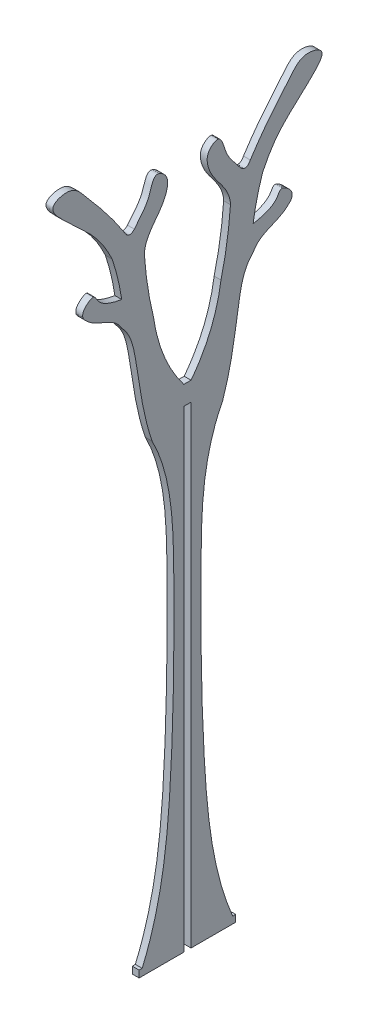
from build123d import *

# Parameters (mm, degrees)
ESTRUSIONE_ESTRUSIONE3_DEPTH = 18


with BuildPart() as part:
    # Schizzo7 → Estrusione-Estrusione3 (new body)
    with BuildSketch(Plane(origin=(0, 0, 0), x_dir=(0, 0, -1), z_dir=(1, 0, 0))):
        with BuildLine():
            Line((-476.786070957, 1122.780178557), (-457.786070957, 1122.780178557))
            Line((-457.786070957, 1122.780178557), (-457.78607096, -120.065063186))
            Line((-457.78607096, -120.065063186), (-340.32855238, -120.065063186))
            Line((-340.32855238, -120.065063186), (-340.32855238, -102.065063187))
            Line((-340.32855238, -102.065063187), (-348.327513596, -102.065063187))
            add(Edge.make_bspline(
                [(-374.416732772, 1085.290340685), (-428.763865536, 980.408727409), (-433.488963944, 703.166417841), (-430.841066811, 362.214519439), (-406.758439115, 77.353361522), (-370.406574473, -50.347198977), (-348.327513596, -102.065063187)],
                knots=[0, 0, 0, 0, 0.287218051, 0.658216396, 0.847460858, 0.984083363, 0.984083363, 0.984083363, 0.984083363], degree=3))
            add(Edge.make_bspline(
                [(-374.416732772, 1085.290340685), (-361.752567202, 1122.390121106), (-345.048249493, 1194.307016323), (-332.104046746, 1296.672666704), (-317.21544491, 1359.36695552), (-294.569377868, 1382.195788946)],
                knots=[0, 0, 0, 0, 0.379260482, 0.713287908, 1, 1, 1, 1], degree=3))
            add(Edge.make_bspline(
                [(-201.939813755, 1445.091225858), (-228.746989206, 1417.179167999), (-275.310990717, 1418.995866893), (-294.569377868, 1382.195788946)],
                knots=[0, 0, 0, 0, 1, 1, 1, 1], degree=3))
            add(Edge.make_bspline(
                [(-201.939813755, 1445.091225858), (-182.916466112, 1459.20417598), (-195.762265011, 1480.591589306), (-223.101636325, 1493.519887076), (-230.565968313, 1475.071968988), (-252.114591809, 1456.460614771), (-277.468960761, 1450.457656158), (-294.569377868, 1447.525569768)],
                knots=[0, 0, 0, 0, 0.336795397, 0.409108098, 0.521188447, 0.643455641, 1, 1, 1, 1], degree=3))
            add(Edge.make_bspline(
                [(-294.569377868, 1447.525569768), (-286.733849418, 1500.793213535), (-269.555985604, 1551.905314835)],
                knots=[0, 0, 0, 1, 1, 1], degree=2))
            add(Edge.make_bspline(
                [(-269.555985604, 1551.905314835), (-232.350307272, 1630.144271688), (-191.88912575, 1651.420554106), (-94.306678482, 1752.338805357), (-154.290662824, 1769.358834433), (-181.756758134, 1751.890311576), (-205.907260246, 1720.877949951), (-249.189179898, 1672.395372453), (-282.701001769, 1625.949832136), (-301.940349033, 1596.300738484)],
                knots=[0, 0, 0, 0, 0.385763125, 0.485334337, 0.571206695, 0.624037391, 0.671733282, 0.795732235, 1, 1, 1, 1], degree=3))
            add(Edge.make_bspline(
                [(-301.940349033, 1596.300738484), (-312.750016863, 1576.237949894), (-327.745318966, 1591.227625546)],
                knots=[0, 0, 0, 1, 1, 1], degree=2))
            add(Edge.make_bspline(
                [(-354.085962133, 1520.557595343), (-354.520611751, 1538.736346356), (-369.940174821, 1570.584189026), (-398.088276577, 1601.986118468), (-410.702447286, 1628.394502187), (-416.129467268, 1648.963321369), (-415.375831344, 1672.971522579), (-380.11555723, 1696.407856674), (-365.079033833, 1632.740590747), (-349.42435991, 1619.179279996), (-327.745318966, 1591.227625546)],
                knots=[0, 0, 0, 0, 0.174589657, 0.335888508, 0.411381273, 0.458067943, 0.543973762, 0.636309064, 0.747697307, 1, 1, 1, 1], degree=3))
            add(Edge.make_bspline(
                [(-354.085962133, 1520.557595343), (-359.632506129, 1440.050330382), (-379.003516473, 1361.525252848)],
                knots=[0, 0, 0, 1, 1, 1], degree=2))
            add(Edge.make_bspline(
                [(-457.78607096, 1172.780178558), (-394.540775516, 1255.12690743), (-379.003516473, 1361.525252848)],
                knots=[0, 0, 0, 1, 1, 1], degree=2))
            Line((-457.78607096, 1172.780178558), (-476.78607096, 1172.780178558))
            add(Edge.make_bspline(
                [(-476.78607096, 1172.780178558), (-540.031366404, 1255.12690743), (-555.568625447, 1361.525252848)],
                knots=[0, 0, 0, 1, 1, 1], degree=2))
            add(Edge.make_bspline(
                [(-580.486179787, 1520.557595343), (-574.939635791, 1440.050330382), (-555.568625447, 1361.525252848)],
                knots=[0, 0, 0, 1, 1, 1], degree=2))
            add(Edge.make_bspline(
                [(-580.486179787, 1520.557595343), (-580.051530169, 1538.736346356), (-564.631967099, 1570.584189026), (-536.483865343, 1601.986118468), (-523.869694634, 1628.394502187), (-518.442674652, 1648.963321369), (-519.196310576, 1672.971522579), (-554.45658469, 1696.407856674), (-569.493108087, 1632.740590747), (-585.14778201, 1619.179279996), (-606.826822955, 1591.227625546)],
                knots=[0, 0, 0, 0, 0.174589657, 0.335888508, 0.411381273, 0.458067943, 0.543973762, 0.636309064, 0.747697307, 1, 1, 1, 1], degree=3))
            add(Edge.make_bspline(
                [(-632.631792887, 1596.300738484), (-621.822125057, 1576.237949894), (-606.826822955, 1591.227625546)],
                knots=[0, 0, 0, 1, 1, 1], degree=2))
            add(Edge.make_bspline(
                [(-665.016156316, 1551.905314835), (-702.221834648, 1630.144271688), (-742.68301617, 1651.420554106), (-840.265463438, 1752.338805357), (-780.281479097, 1769.358834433), (-752.815383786, 1751.890311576), (-728.664881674, 1720.877949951), (-685.382962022, 1672.395372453), (-651.871140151, 1625.949832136), (-632.631792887, 1596.300738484)],
                knots=[0, 0, 0, 0, 0.385763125, 0.485334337, 0.571206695, 0.624037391, 0.671733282, 0.795732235, 1, 1, 1, 1], degree=3))
            add(Edge.make_bspline(
                [(-640.002764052, 1447.525569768), (-647.838292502, 1500.793213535), (-665.016156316, 1551.905314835)],
                knots=[0, 0, 0, 1, 1, 1], degree=2))
            add(Edge.make_bspline(
                [(-732.632328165, 1445.091225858), (-751.655675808, 1459.20417598), (-738.809876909, 1480.591589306), (-711.470505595, 1493.519887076), (-704.006173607, 1475.071968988), (-682.457550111, 1456.46061477), (-657.103181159, 1450.457656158), (-640.002764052, 1447.525569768)],
                knots=[0, 0, 0, 0, 0.336795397, 0.409108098, 0.521188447, 0.643455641, 1, 1, 1, 1], degree=3))
            add(Edge.make_bspline(
                [(-732.632328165, 1445.091225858), (-705.825152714, 1417.179167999), (-659.261151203, 1418.995866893), (-640.002764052, 1382.195788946)],
                knots=[0, 0, 0, 0, 1, 1, 1, 1], degree=3))
            add(Edge.make_bspline(
                [(-560.155409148, 1085.290340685), (-572.819574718, 1122.390121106), (-589.523892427, 1194.307016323), (-602.468095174, 1296.672666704), (-617.35669701, 1359.36695552), (-640.002764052, 1382.195788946)],
                knots=[0, 0, 0, 0, 0.379260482, 0.713287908, 1, 1, 1, 1], degree=3))
            add(Edge.make_bspline(
                [(-560.155409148, 1085.290340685), (-505.808276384, 980.408727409), (-501.083177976, 703.166417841), (-503.731075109, 362.214519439), (-527.813702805, 77.353361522), (-564.165567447, -50.347198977), (-586.244628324, -102.065063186)],
                knots=[0, 0, 0, 0, 0.287218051, 0.658216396, 0.847460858, 0.984083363, 0.984083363, 0.984083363, 0.984083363], degree=3))
            Line((-586.244628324, -102.065063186), (-594.24358954, -102.065063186))
            Line((-594.24358954, -102.065063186), (-594.24358954, -120.065063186))
            Line((-594.24358954, -120.065063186), (-476.78607096, -120.065063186))
            Line((-476.78607096, -120.065063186), (-476.786070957, 1122.780178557))
        make_face()
    extrude(amount=ESTRUSIONE_ESTRUSIONE3_DEPTH)


solid = part.part
